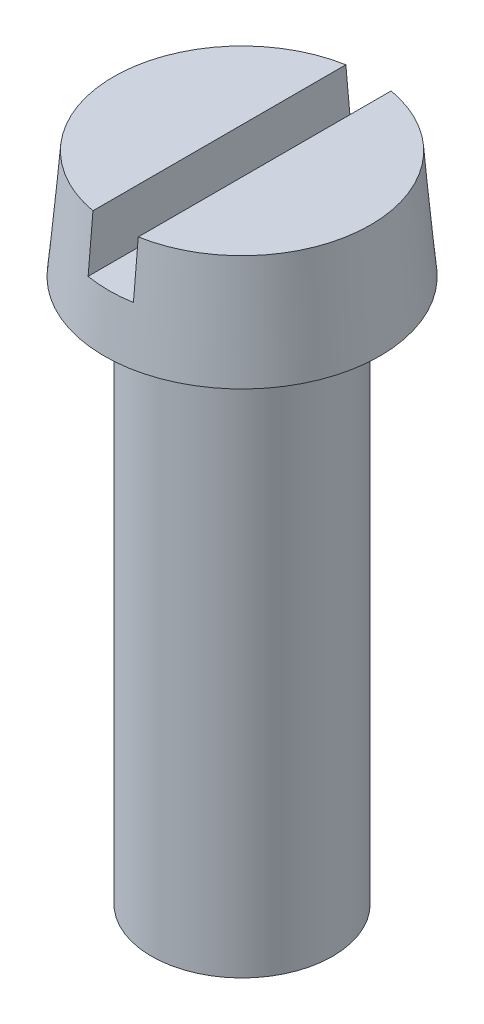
from build123d import *

# Parameters (mm, degrees)
SKETCH3_W      = 7.5
SKETCH3_H      = 51.766180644
EXTRUDE1_DEPTH = 21


with BuildPart() as part:
    # Sketch1 → Revolve1 (revolve)
    with BuildSketch(Plane.XY):
        Polygon((0, 108), (0, 0), (15, 0), (15, 90), (22.844329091, 90), (21.269533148, 108), align=None)
    revolve(axis=Axis((0, 0, 0), (0, 1, 0)))

    # Sketch3 → Extrude1 (cut)
    with BuildSketch(Plane(origin=(0, 120, 0), x_dir=(-1, 0, 0), z_dir=(0, 1, 0))):
        Rectangle(SKETCH3_W, SKETCH3_H)
    extrude(amount=-EXTRUDE1_DEPTH, mode=Mode.SUBTRACT)


solid = part.part
